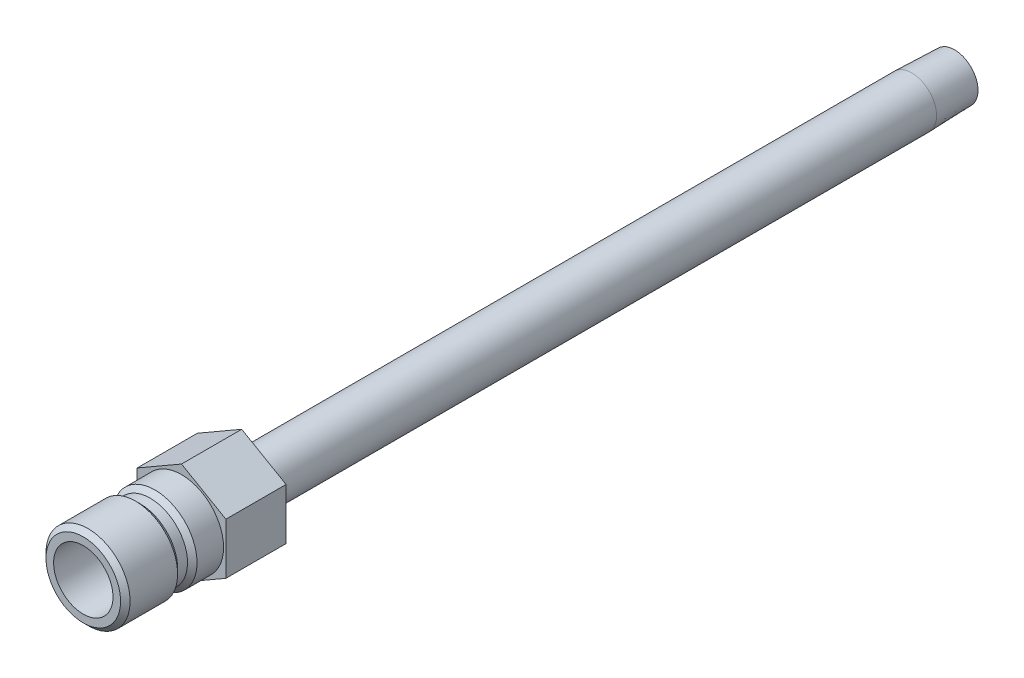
from build123d import *

# Parameters (mm, degrees)
SKETCH2_R           = 2.6543
BOSS_EXTRUDE1_DEPTH = 9.652


with BuildPart() as part:
    # Sketch1 → Revolve1 (revolve)
    with BuildSketch(Plane(origin=(0, 0, 0), x_dir=(0, 0, -1), z_dir=(1, 0, 0))):
        Polygon((-15.748, 4.7625), (-15.748, 5.9817), (-14.986, 6.7437), (-7.366, 6.7437), (-6.604, 5.9817), (-5.0165, 5.9817), (-4.2545, 6.7437), (9.652, 6.7437), (9.652, 3.96875), (117.094, 3.96875), (123.952, 3.754438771), (123.952, 2.6543), (-2.435050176, 2.6543), (-3.556, 4.7625), align=None)
    revolve(axis=Axis((0, 0, -9.652), (0, 0, 1)))

    # Sketch2 → Boss-Extrude1 (add)
    with BuildSketch(Plane.XY):
        Polygon((-7.112, 4.106115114), (-7.112, -4.106115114), (0, -8.212230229), (7.112, -4.106115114), (7.112, 4.106115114), (0, 8.212230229), align=None)
        with Locations(Location((0, 0, 0), (0, 0, 90))):
            Circle(SKETCH2_R, mode=Mode.SUBTRACT)
    extrude(amount=-BOSS_EXTRUDE1_DEPTH)


solid = part.part
